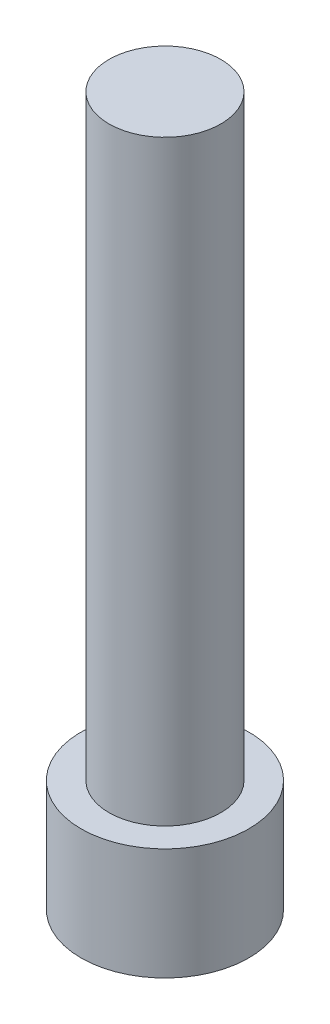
ISO-10303-21;
HEADER;
FILE_DESCRIPTION(('STEP AP214'),'2;1');
FILE_NAME('part.step','',(''),(''),'','','');
FILE_SCHEMA(('AUTOMOTIVE_DESIGN { 1 0 10303 214 1 1 1 1 }'));
ENDSEC;
DATA;
#1=APPLICATION_CONTEXT('core data for automotive mechanical design processes');
#2=APPLICATION_PROTOCOL_DEFINITION('international standard','automotive_design',2000,#1);
#3=PRODUCT_CONTEXT('',#1,'mechanical');
#4=PRODUCT('Part','Part','',(#3));
#5=PRODUCT_RELATED_PRODUCT_CATEGORY('part','',(#4));
#6=PRODUCT_DEFINITION_FORMATION('','',#4);
#7=PRODUCT_DEFINITION_CONTEXT('part definition',#1,'design');
#8=PRODUCT_DEFINITION('design','',#6,#7);
#9=PRODUCT_DEFINITION_SHAPE('','',#8);
#10=(LENGTH_UNIT() NAMED_UNIT(*) SI_UNIT(.MILLI.,.METRE.));
#11=(NAMED_UNIT(*) PLANE_ANGLE_UNIT() SI_UNIT($,.RADIAN.));
#12=(NAMED_UNIT(*) SI_UNIT($,.STERADIAN.) SOLID_ANGLE_UNIT());
#13=UNCERTAINTY_MEASURE_WITH_UNIT(LENGTH_MEASURE(1.E-05),#10,'distance_accuracy_value','');
#14=(GEOMETRIC_REPRESENTATION_CONTEXT(3) GLOBAL_UNCERTAINTY_ASSIGNED_CONTEXT((#13)) GLOBAL_UNIT_ASSIGNED_CONTEXT((#10,
#11,#12)) REPRESENTATION_CONTEXT('',''));
#15=CARTESIAN_POINT('',(0.,0.,0.));
#16=DIRECTION('',(0.,0.,1.));
#17=DIRECTION('',(1.,0.,0.));
#18=AXIS2_PLACEMENT_3D('',#15,#16,#17);
#19=CARTESIAN_POINT('',(0.,3.,0.));
#20=DIRECTION('',(0.,-1.,0.));
#21=DIRECTION('',(0.,0.,-1.));
#22=AXIS2_PLACEMENT_3D('',#19,#20,#21);
#23=CYLINDRICAL_SURFACE('',#22,2.25);
#24=CARTESIAN_POINT('',(0.,3.,0.));
#25=DIRECTION('',(0.,1.,0.));
#26=DIRECTION('',(0.,0.,1.));
#27=AXIS2_PLACEMENT_3D('',#24,#25,#26);
#28=CIRCLE('',#27,2.25);
#29=CARTESIAN_POINT('',(0.,3.,2.25));
#30=VERTEX_POINT('',#29);
#31=EDGE_CURVE('E51',#30,#30,#28,.T.);
#32=ORIENTED_EDGE('',*,*,#31,.F.);
#33=EDGE_LOOP('',(#32));
#34=FACE_BOUND('',#33,.T.);
#35=CARTESIAN_POINT('',(0.,0.,0.));
#36=DIRECTION('',(0.,1.,0.));
#37=DIRECTION('',(0.,0.,1.));
#38=AXIS2_PLACEMENT_3D('',#35,#36,#37);
#39=CIRCLE('',#38,2.25);
#40=CARTESIAN_POINT('',(0.,0.,2.25));
#41=VERTEX_POINT('',#40);
#42=EDGE_CURVE('E46',#41,#41,#39,.T.);
#43=ORIENTED_EDGE('',*,*,#42,.T.);
#44=EDGE_LOOP('',(#43));
#45=FACE_BOUND('',#44,.T.);
#46=ADVANCED_FACE('F43',(#34,#45),#23,.T.);
#47=CARTESIAN_POINT('',(0.,3.,0.));
#48=DIRECTION('',(0.,1.,0.));
#49=DIRECTION('',(0.,0.,1.));
#50=AXIS2_PLACEMENT_3D('',#47,#48,#49);
#51=PLANE('',#50);
#52=CARTESIAN_POINT('',(0.,3.,0.));
#53=DIRECTION('',(0.,1.,0.));
#54=DIRECTION('',(0.,0.,1.));
#55=AXIS2_PLACEMENT_3D('',#52,#53,#54);
#56=CIRCLE('',#55,1.5);
#57=CARTESIAN_POINT('',(0.,3.,1.5));
#58=VERTEX_POINT('',#57);
#59=EDGE_CURVE('E11',#58,#58,#56,.T.);
#60=ORIENTED_EDGE('',*,*,#59,.F.);
#61=EDGE_LOOP('',(#60));
#62=FACE_BOUND('',#61,.T.);
#63=ORIENTED_EDGE('',*,*,#31,.T.);
#64=EDGE_LOOP('',(#63));
#65=FACE_BOUND('',#64,.T.);
#66=ADVANCED_FACE('F161',(#62,#65),#51,.T.);
#67=CARTESIAN_POINT('',(0.,0.,0.));
#68=DIRECTION('',(0.,1.,0.));
#69=DIRECTION('',(0.,0.,1.));
#70=AXIS2_PLACEMENT_3D('',#67,#68,#69);
#71=PLANE('',#70);
#72=DIRECTION('',(0.188366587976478,0.,0.982098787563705));
#73=VECTOR('',#72,1.);
#74=CARTESIAN_POINT('',(1.09168160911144,0.,-0.944226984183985));
#75=LINE('',#74,#73);
#76=CARTESIAN_POINT('',(1.09168160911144,0.,-0.944226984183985));
#77=VERTEX_POINT('',#76);
#78=CARTESIAN_POINT('',(1.36356535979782,0.,0.47331051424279));
#79=VERTEX_POINT('',#78);
#80=EDGE_CURVE('E135',#77,#79,#75,.T.);
#81=ORIENTED_EDGE('',*,*,#80,.F.);
#82=DIRECTION('',(0.944705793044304,0.,0.327919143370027));
#83=VECTOR('',#82,1.);
#84=CARTESIAN_POINT('',(-0.271883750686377,0.,-1.41753749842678));
#85=LINE('',#84,#83);
#86=CARTESIAN_POINT('',(-0.271883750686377,0.,-1.41753749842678));
#87=VERTEX_POINT('',#86);
#88=EDGE_CURVE('E56',#87,#77,#85,.T.);
#89=ORIENTED_EDGE('',*,*,#88,.F.);
#90=DIRECTION('',(0.756339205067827,0.,-0.654179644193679));
#91=VECTOR('',#90,1.);
#92=CARTESIAN_POINT('',(-1.36356535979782,0.,-0.473310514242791));
#93=LINE('',#92,#91);
#94=CARTESIAN_POINT('',(-1.36356535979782,0.,-0.473310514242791));
#95=VERTEX_POINT('',#94);
#96=EDGE_CURVE('E145',#95,#87,#93,.T.);
#97=ORIENTED_EDGE('',*,*,#96,.F.);
#98=DIRECTION('',(-0.188366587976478,0.,-0.982098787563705));
#99=VECTOR('',#98,1.);
#100=CARTESIAN_POINT('',(-1.09168160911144,0.,0.944226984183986));
#101=LINE('',#100,#99);
#102=CARTESIAN_POINT('',(-1.09168160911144,0.,0.944226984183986));
#103=VERTEX_POINT('',#102);
#104=EDGE_CURVE('E136',#103,#95,#101,.T.);
#105=ORIENTED_EDGE('',*,*,#104,.F.);
#106=DIRECTION('',(-0.944705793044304,0.,-0.327919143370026));
#107=VECTOR('',#106,1.);
#108=CARTESIAN_POINT('',(0.271883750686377,0.,1.41753749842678));
#109=LINE('',#108,#107);
#110=CARTESIAN_POINT('',(0.271883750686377,0.,1.41753749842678));
#111=VERTEX_POINT('',#110);
#112=EDGE_CURVE('E110',#111,#103,#109,.T.);
#113=ORIENTED_EDGE('',*,*,#112,.F.);
#114=DIRECTION('',(-0.756339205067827,0.,0.654179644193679));
#115=VECTOR('',#114,1.);
#116=CARTESIAN_POINT('',(1.36356535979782,0.,0.47331051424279));
#117=LINE('',#116,#115);
#118=EDGE_CURVE('E138',#79,#111,#117,.T.);
#119=ORIENTED_EDGE('',*,*,#118,.F.);
#120=EDGE_LOOP('',(#81,#89,#97,#105,#113,#119));
#121=FACE_BOUND('',#120,.T.);
#122=ORIENTED_EDGE('',*,*,#42,.F.);
#123=EDGE_LOOP('',(#122));
#124=FACE_BOUND('',#123,.T.);
#125=ADVANCED_FACE('F156',(#121,#124),#71,.F.);
#126=CARTESIAN_POINT('',(0.,19.,0.));
#127=DIRECTION('',(0.,-1.,0.));
#128=DIRECTION('',(0.,0.,-1.));
#129=AXIS2_PLACEMENT_3D('',#126,#127,#128);
#130=CYLINDRICAL_SURFACE('',#129,1.5);
#131=CARTESIAN_POINT('',(0.,19.,0.));
#132=DIRECTION('',(0.,1.,0.));
#133=DIRECTION('',(0.,0.,1.));
#134=AXIS2_PLACEMENT_3D('',#131,#132,#133);
#135=CIRCLE('',#134,1.5);
#136=CARTESIAN_POINT('',(0.,19.,1.5));
#137=VERTEX_POINT('',#136);
#138=EDGE_CURVE('E147',#137,#137,#135,.T.);
#139=ORIENTED_EDGE('',*,*,#138,.F.);
#140=EDGE_LOOP('',(#139));
#141=FACE_BOUND('',#140,.T.);
#142=ORIENTED_EDGE('',*,*,#59,.T.);
#143=EDGE_LOOP('',(#142));
#144=FACE_BOUND('',#143,.T.);
#145=ADVANCED_FACE('F162',(#141,#144),#130,.T.);
#146=CARTESIAN_POINT('',(0.,19.,0.));
#147=DIRECTION('',(0.,1.,0.));
#148=DIRECTION('',(0.,0.,1.));
#149=AXIS2_PLACEMENT_3D('',#146,#147,#148);
#150=PLANE('',#149);
#151=ORIENTED_EDGE('',*,*,#138,.T.);
#152=EDGE_LOOP('',(#151));
#153=FACE_BOUND('',#152,.T.);
#154=ADVANCED_FACE('F167',(#153),#150,.T.);
#155=CARTESIAN_POINT('',(-0.271883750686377,1.5,-1.41753749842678));
#156=DIRECTION('',(0.327919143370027,0.,-0.944705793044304));
#157=DIRECTION('',(-0.944705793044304,0.,-0.327919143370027));
#158=AXIS2_PLACEMENT_3D('',#155,#156,#157);
#159=PLANE('',#158);
#160=ORIENTED_EDGE('',*,*,#88,.T.);
#161=DIRECTION('',(0.,-1.,0.));
#162=VECTOR('',#161,1.);
#163=CARTESIAN_POINT('',(1.09168160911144,1.5,-0.944226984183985));
#164=LINE('',#163,#162);
#165=CARTESIAN_POINT('',(1.09168160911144,1.5,-0.944226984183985));
#166=VERTEX_POINT('',#165);
#167=EDGE_CURVE('E88',#166,#77,#164,.T.);
#168=ORIENTED_EDGE('',*,*,#167,.F.);
#169=DIRECTION('',(0.944705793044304,0.,0.327919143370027));
#170=VECTOR('',#169,1.);
#171=CARTESIAN_POINT('',(-0.271883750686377,1.5,-1.41753749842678));
#172=LINE('',#171,#170);
#173=CARTESIAN_POINT('',(-0.271883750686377,1.5,-1.41753749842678));
#174=VERTEX_POINT('',#173);
#175=EDGE_CURVE('E144',#174,#166,#172,.T.);
#176=ORIENTED_EDGE('',*,*,#175,.F.);
#177=DIRECTION('',(0.,-1.,0.));
#178=VECTOR('',#177,1.);
#179=CARTESIAN_POINT('',(-0.271883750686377,1.5,-1.41753749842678));
#180=LINE('',#179,#178);
#181=EDGE_CURVE('E66',#174,#87,#180,.T.);
#182=ORIENTED_EDGE('',*,*,#181,.T.);
#183=EDGE_LOOP('',(#160,#168,#176,#182));
#184=FACE_BOUND('',#183,.T.);
#185=ADVANCED_FACE('F200',(#184),#159,.F.);
#186=CARTESIAN_POINT('',(-1.36356535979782,1.5,-0.473310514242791));
#187=DIRECTION('',(-0.654179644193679,0.,-0.756339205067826));
#188=DIRECTION('',(-0.756339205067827,0.,0.654179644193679));
#189=AXIS2_PLACEMENT_3D('',#186,#187,#188);
#190=PLANE('',#189);
#191=ORIENTED_EDGE('',*,*,#96,.T.);
#192=ORIENTED_EDGE('',*,*,#181,.F.);
#193=DIRECTION('',(0.756339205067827,0.,-0.654179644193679));
#194=VECTOR('',#193,1.);
#195=CARTESIAN_POINT('',(-1.36356535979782,1.5,-0.473310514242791));
#196=LINE('',#195,#194);
#197=CARTESIAN_POINT('',(-1.36356535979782,1.5,-0.473310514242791));
#198=VERTEX_POINT('',#197);
#199=EDGE_CURVE('E118',#198,#174,#196,.T.);
#200=ORIENTED_EDGE('',*,*,#199,.F.);
#201=DIRECTION('',(0.,-1.,0.));
#202=VECTOR('',#201,1.);
#203=CARTESIAN_POINT('',(-1.36356535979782,1.5,-0.473310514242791));
#204=LINE('',#203,#202);
#205=EDGE_CURVE('E111',#198,#95,#204,.T.);
#206=ORIENTED_EDGE('',*,*,#205,.T.);
#207=EDGE_LOOP('',(#191,#192,#200,#206));
#208=FACE_BOUND('',#207,.T.);
#209=ADVANCED_FACE('F208',(#208),#190,.F.);
#210=CARTESIAN_POINT('',(-1.09168160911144,1.5,0.944226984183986));
#211=DIRECTION('',(-0.982098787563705,0.,0.188366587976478));
#212=DIRECTION('',(0.188366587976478,0.,0.982098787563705));
#213=AXIS2_PLACEMENT_3D('',#210,#211,#212);
#214=PLANE('',#213);
#215=ORIENTED_EDGE('',*,*,#104,.T.);
#216=ORIENTED_EDGE('',*,*,#205,.F.);
#217=DIRECTION('',(-0.188366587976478,0.,-0.982098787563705));
#218=VECTOR('',#217,1.);
#219=CARTESIAN_POINT('',(-1.09168160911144,1.5,0.944226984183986));
#220=LINE('',#219,#218);
#221=CARTESIAN_POINT('',(-1.09168160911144,1.5,0.944226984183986));
#222=VERTEX_POINT('',#221);
#223=EDGE_CURVE('E114',#222,#198,#220,.T.);
#224=ORIENTED_EDGE('',*,*,#223,.F.);
#225=DIRECTION('',(0.,-1.,0.));
#226=VECTOR('',#225,1.);
#227=CARTESIAN_POINT('',(-1.09168160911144,1.5,0.944226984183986));
#228=LINE('',#227,#226);
#229=EDGE_CURVE('E99',#222,#103,#228,.T.);
#230=ORIENTED_EDGE('',*,*,#229,.T.);
#231=EDGE_LOOP('',(#215,#216,#224,#230));
#232=FACE_BOUND('',#231,.T.);
#233=ADVANCED_FACE('F116',(#232),#214,.F.);
#234=CARTESIAN_POINT('',(0.271883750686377,1.5,1.41753749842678));
#235=DIRECTION('',(-0.327919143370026,0.,0.944705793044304));
#236=DIRECTION('',(0.944705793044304,0.,0.327919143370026));
#237=AXIS2_PLACEMENT_3D('',#234,#235,#236);
#238=PLANE('',#237);
#239=ORIENTED_EDGE('',*,*,#112,.T.);
#240=ORIENTED_EDGE('',*,*,#229,.F.);
#241=DIRECTION('',(-0.944705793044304,0.,-0.327919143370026));
#242=VECTOR('',#241,1.);
#243=CARTESIAN_POINT('',(0.271883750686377,1.5,1.41753749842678));
#244=LINE('',#243,#242);
#245=CARTESIAN_POINT('',(0.271883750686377,1.5,1.41753749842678));
#246=VERTEX_POINT('',#245);
#247=EDGE_CURVE('E104',#246,#222,#244,.T.);
#248=ORIENTED_EDGE('',*,*,#247,.F.);
#249=DIRECTION('',(0.,-1.,0.));
#250=VECTOR('',#249,1.);
#251=CARTESIAN_POINT('',(0.271883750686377,1.5,1.41753749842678));
#252=LINE('',#251,#250);
#253=EDGE_CURVE('E115',#246,#111,#252,.T.);
#254=ORIENTED_EDGE('',*,*,#253,.T.);
#255=EDGE_LOOP('',(#239,#240,#248,#254));
#256=FACE_BOUND('',#255,.T.);
#257=ADVANCED_FACE('F105',(#256),#238,.F.);
#258=CARTESIAN_POINT('',(1.36356535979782,1.5,0.47331051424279));
#259=DIRECTION('',(0.654179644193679,0.,0.756339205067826));
#260=DIRECTION('',(0.756339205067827,0.,-0.654179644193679));
#261=AXIS2_PLACEMENT_3D('',#258,#259,#260);
#262=PLANE('',#261);
#263=ORIENTED_EDGE('',*,*,#118,.T.);
#264=ORIENTED_EDGE('',*,*,#253,.F.);
#265=DIRECTION('',(-0.756339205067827,0.,0.654179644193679));
#266=VECTOR('',#265,1.);
#267=CARTESIAN_POINT('',(1.36356535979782,1.5,0.47331051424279));
#268=LINE('',#267,#266);
#269=CARTESIAN_POINT('',(1.36356535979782,1.5,0.47331051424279));
#270=VERTEX_POINT('',#269);
#271=EDGE_CURVE('E123',#270,#246,#268,.T.);
#272=ORIENTED_EDGE('',*,*,#271,.F.);
#273=DIRECTION('',(0.,-1.,0.));
#274=VECTOR('',#273,1.);
#275=CARTESIAN_POINT('',(1.36356535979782,1.5,0.47331051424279));
#276=LINE('',#275,#274);
#277=EDGE_CURVE('E146',#270,#79,#276,.T.);
#278=ORIENTED_EDGE('',*,*,#277,.T.);
#279=EDGE_LOOP('',(#263,#264,#272,#278));
#280=FACE_BOUND('',#279,.T.);
#281=ADVANCED_FACE('F232',(#280),#262,.F.);
#282=CARTESIAN_POINT('',(1.09168160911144,1.5,-0.944226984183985));
#283=DIRECTION('',(0.982098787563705,0.,-0.188366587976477));
#284=DIRECTION('',(-0.188366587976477,0.,-0.982098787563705));
#285=AXIS2_PLACEMENT_3D('',#282,#283,#284);
#286=PLANE('',#285);
#287=ORIENTED_EDGE('',*,*,#80,.T.);
#288=ORIENTED_EDGE('',*,*,#277,.F.);
#289=DIRECTION('',(0.188366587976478,0.,0.982098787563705));
#290=VECTOR('',#289,1.);
#291=CARTESIAN_POINT('',(1.09168160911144,1.5,-0.944226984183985));
#292=LINE('',#291,#290);
#293=EDGE_CURVE('E130',#166,#270,#292,.T.);
#294=ORIENTED_EDGE('',*,*,#293,.F.);
#295=ORIENTED_EDGE('',*,*,#167,.T.);
#296=EDGE_LOOP('',(#287,#288,#294,#295));
#297=FACE_BOUND('',#296,.T.);
#298=ADVANCED_FACE('F242',(#297),#286,.F.);
#299=CARTESIAN_POINT('',(0.,1.5,0.));
#300=DIRECTION('',(0.,-1.,0.));
#301=DIRECTION('',(0.,0.,-1.));
#302=AXIS2_PLACEMENT_3D('',#299,#300,#301);
#303=PLANE('',#302);
#304=ORIENTED_EDGE('',*,*,#175,.T.);
#305=ORIENTED_EDGE('',*,*,#293,.T.);
#306=ORIENTED_EDGE('',*,*,#271,.T.);
#307=ORIENTED_EDGE('',*,*,#247,.T.);
#308=ORIENTED_EDGE('',*,*,#223,.T.);
#309=ORIENTED_EDGE('',*,*,#199,.T.);
#310=EDGE_LOOP('',(#304,#305,#306,#307,#308,#309));
#311=FACE_BOUND('',#310,.T.);
#312=ADVANCED_FACE('F125',(#311),#303,.T.);
#313=CLOSED_SHELL('',(#46,#66,#125,#145,#154,#185,#209,#233,#257,#281,#298,#312));
#314=MANIFOLD_SOLID_BREP('B2',#313);
#315=ADVANCED_BREP_SHAPE_REPRESENTATION('',(#18,#314),#14);
#316=SHAPE_DEFINITION_REPRESENTATION(#9,#315);
ENDSEC;
END-ISO-10303-21;
